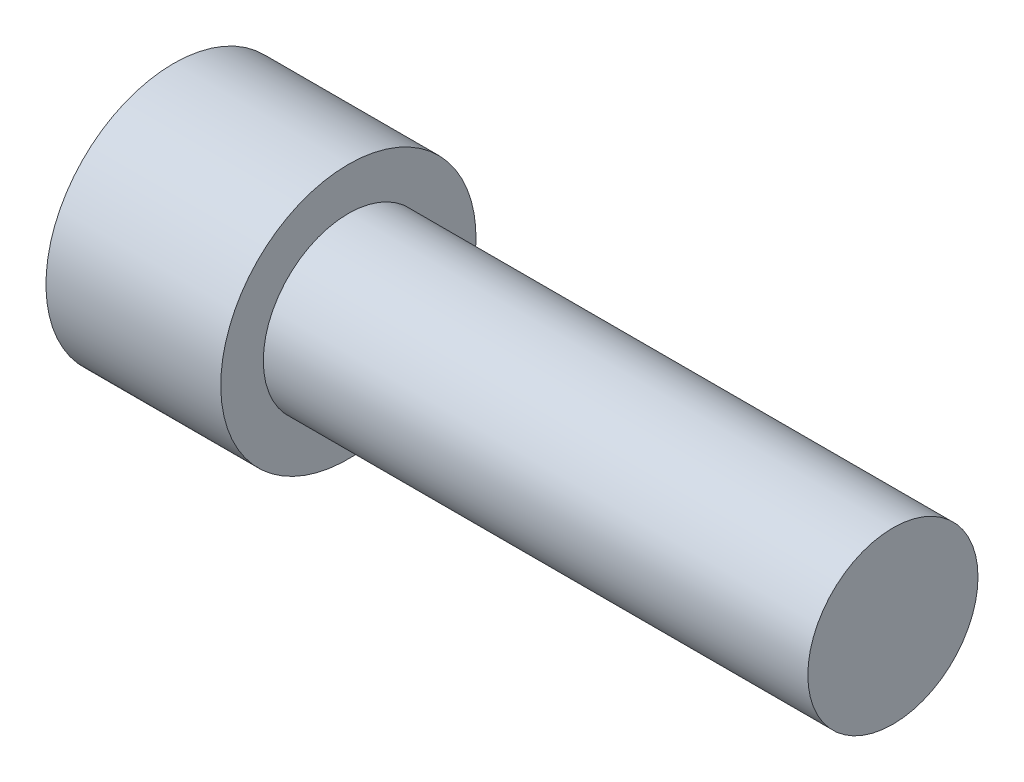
ISO-10303-21;
HEADER;
FILE_DESCRIPTION(('STEP AP214'),'2;1');
FILE_NAME('part.step','',(''),(''),'','','');
FILE_SCHEMA(('AUTOMOTIVE_DESIGN { 1 0 10303 214 1 1 1 1 }'));
ENDSEC;
DATA;
#1=APPLICATION_CONTEXT('core data for automotive mechanical design processes');
#2=APPLICATION_PROTOCOL_DEFINITION('international standard','automotive_design',2000,#1);
#3=PRODUCT_CONTEXT('',#1,'mechanical');
#4=PRODUCT('Part','Part','',(#3));
#5=PRODUCT_RELATED_PRODUCT_CATEGORY('part','',(#4));
#6=PRODUCT_DEFINITION_FORMATION('','',#4);
#7=PRODUCT_DEFINITION_CONTEXT('part definition',#1,'design');
#8=PRODUCT_DEFINITION('design','',#6,#7);
#9=PRODUCT_DEFINITION_SHAPE('','',#8);
#10=(LENGTH_UNIT() NAMED_UNIT(*) SI_UNIT(.MILLI.,.METRE.));
#11=(NAMED_UNIT(*) PLANE_ANGLE_UNIT() SI_UNIT($,.RADIAN.));
#12=(NAMED_UNIT(*) SI_UNIT($,.STERADIAN.) SOLID_ANGLE_UNIT());
#13=UNCERTAINTY_MEASURE_WITH_UNIT(LENGTH_MEASURE(1.E-05),#10,'distance_accuracy_value','');
#14=(GEOMETRIC_REPRESENTATION_CONTEXT(3) GLOBAL_UNCERTAINTY_ASSIGNED_CONTEXT((#13)) GLOBAL_UNIT_ASSIGNED_CONTEXT((#10,
#11,#12)) REPRESENTATION_CONTEXT('',''));
#15=CARTESIAN_POINT('',(0.,0.,0.));
#16=DIRECTION('',(0.,0.,1.));
#17=DIRECTION('',(1.,0.,0.));
#18=AXIS2_PLACEMENT_3D('',#15,#16,#17);
#19=CARTESIAN_POINT('',(33.5534,0.,0.));
#20=DIRECTION('',(1.,0.,0.));
#21=DIRECTION('',(0.,1.,0.));
#22=AXIS2_PLACEMENT_3D('',#19,#20,#21);
#23=PLANE('',#22);
#24=CARTESIAN_POINT('',(33.5534,0.,0.));
#25=DIRECTION('',(1.,0.,0.));
#26=DIRECTION('',(0.,1.,0.));
#27=AXIS2_PLACEMENT_3D('',#24,#25,#26);
#28=CIRCLE('',#27,3.96875);
#29=CARTESIAN_POINT('',(33.5534,3.96875,0.));
#30=VERTEX_POINT('',#29);
#31=EDGE_CURVE('E11',#30,#30,#28,.T.);
#32=ORIENTED_EDGE('',*,*,#31,.T.);
#33=EDGE_LOOP('',(#32));
#34=FACE_BOUND('',#33,.T.);
#35=ADVANCED_FACE('F380',(#34),#23,.T.);
#36=CARTESIAN_POINT('',(33.5534,0.,0.));
#37=DIRECTION('',(1.,0.,0.));
#38=DIRECTION('',(0.,1.,0.));
#39=AXIS2_PLACEMENT_3D('',#36,#37,#38);
#40=CYLINDRICAL_SURFACE('',#39,3.96875);
#41=CARTESIAN_POINT('',(8.1534,0.,0.));
#42=DIRECTION('',(1.,0.,0.));
#43=DIRECTION('',(0.,1.,0.));
#44=AXIS2_PLACEMENT_3D('',#41,#42,#43);
#45=CIRCLE('',#44,3.96875);
#46=CARTESIAN_POINT('',(8.1534,3.96875,0.));
#47=VERTEX_POINT('',#46);
#48=EDGE_CURVE('E387',#47,#47,#45,.T.);
#49=ORIENTED_EDGE('',*,*,#48,.T.);
#50=EDGE_LOOP('',(#49));
#51=FACE_BOUND('',#50,.T.);
#52=ORIENTED_EDGE('',*,*,#31,.F.);
#53=EDGE_LOOP('',(#52));
#54=FACE_BOUND('',#53,.T.);
#55=ADVANCED_FACE('F496',(#51,#54),#40,.T.);
#56=CARTESIAN_POINT('',(8.1534,5.953125,0.));
#57=DIRECTION('',(1.,0.,0.));
#58=DIRECTION('',(0.,1.,0.));
#59=AXIS2_PLACEMENT_3D('',#56,#57,#58);
#60=PLANE('',#59);
#61=CARTESIAN_POINT('',(8.1534,0.,0.));
#62=DIRECTION('',(1.,0.,0.));
#63=DIRECTION('',(0.,1.,0.));
#64=AXIS2_PLACEMENT_3D('',#61,#62,#63);
#65=CIRCLE('',#64,5.953125);
#66=CARTESIAN_POINT('',(8.1534,5.953125,0.));
#67=VERTEX_POINT('',#66);
#68=EDGE_CURVE('E491',#67,#67,#65,.T.);
#69=ORIENTED_EDGE('',*,*,#68,.T.);
#70=EDGE_LOOP('',(#69));
#71=FACE_BOUND('',#70,.T.);
#72=ORIENTED_EDGE('',*,*,#48,.F.);
#73=EDGE_LOOP('',(#72));
#74=FACE_BOUND('',#73,.T.);
#75=ADVANCED_FACE('F499',(#71,#74),#60,.T.);
#76=CARTESIAN_POINT('',(33.5534,0.,0.));
#77=DIRECTION('',(1.,0.,0.));
#78=DIRECTION('',(0.,1.,0.));
#79=AXIS2_PLACEMENT_3D('',#76,#77,#78);
#80=CYLINDRICAL_SURFACE('',#79,5.953125);
#81=CARTESIAN_POINT('',(0.,0.,0.));
#82=DIRECTION('',(1.,0.,0.));
#83=DIRECTION('',(0.,1.,0.));
#84=AXIS2_PLACEMENT_3D('',#81,#82,#83);
#85=CIRCLE('',#84,5.953125);
#86=CARTESIAN_POINT('',(0.,5.953125,0.));
#87=VERTEX_POINT('',#86);
#88=EDGE_CURVE('E482',#87,#87,#85,.T.);
#89=ORIENTED_EDGE('',*,*,#88,.T.);
#90=EDGE_LOOP('',(#89));
#91=FACE_BOUND('',#90,.T.);
#92=ORIENTED_EDGE('',*,*,#68,.F.);
#93=EDGE_LOOP('',(#92));
#94=FACE_BOUND('',#93,.T.);
#95=ADVANCED_FACE('F501',(#91,#94),#80,.T.);
#96=CARTESIAN_POINT('',(0.,0.,0.));
#97=DIRECTION('',(-1.,0.,0.));
#98=DIRECTION('',(0.,-1.,0.));
#99=AXIS2_PLACEMENT_3D('',#96,#97,#98);
#100=PLANE('',#99);
#101=DIRECTION('',(0.,0.866025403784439,0.5));
#102=VECTOR('',#101,1.);
#103=CARTESIAN_POINT('',(0.,-3.175,1.83308710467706));
#104=LINE('',#103,#102);
#105=CARTESIAN_POINT('',(0.,-3.175,1.83308710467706));
#106=VERTEX_POINT('',#105);
#107=CARTESIAN_POINT('',(0.,0.,3.66617420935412));
#108=VERTEX_POINT('',#107);
#109=EDGE_CURVE('E394',#106,#108,#104,.T.);
#110=ORIENTED_EDGE('',*,*,#109,.F.);
#111=DIRECTION('',(0.,0.,1.));
#112=VECTOR('',#111,1.);
#113=CARTESIAN_POINT('',(0.,-3.175,-1.83308710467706));
#114=LINE('',#113,#112);
#115=CARTESIAN_POINT('',(0.,-3.175,-1.83308710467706));
#116=VERTEX_POINT('',#115);
#117=EDGE_CURVE('E464',#116,#106,#114,.T.);
#118=ORIENTED_EDGE('',*,*,#117,.F.);
#119=DIRECTION('',(0.,-0.866025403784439,0.5));
#120=VECTOR('',#119,1.);
#121=CARTESIAN_POINT('',(0.,0.,-3.66617420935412));
#122=LINE('',#121,#120);
#123=CARTESIAN_POINT('',(0.,0.,-3.66617420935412));
#124=VERTEX_POINT('',#123);
#125=EDGE_CURVE('E458',#124,#116,#122,.T.);
#126=ORIENTED_EDGE('',*,*,#125,.F.);
#127=DIRECTION('',(0.,-0.866025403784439,-0.5));
#128=VECTOR('',#127,1.);
#129=CARTESIAN_POINT('',(0.,3.175,-1.83308710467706));
#130=LINE('',#129,#128);
#131=CARTESIAN_POINT('',(0.,3.175,-1.83308710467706));
#132=VERTEX_POINT('',#131);
#133=EDGE_CURVE('E456',#132,#124,#130,.T.);
#134=ORIENTED_EDGE('',*,*,#133,.F.);
#135=DIRECTION('',(0.,0.,-1.));
#136=VECTOR('',#135,1.);
#137=CARTESIAN_POINT('',(0.,3.175,1.83308710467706));
#138=LINE('',#137,#136);
#139=CARTESIAN_POINT('',(0.,3.175,1.83308710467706));
#140=VERTEX_POINT('',#139);
#141=EDGE_CURVE('E437',#140,#132,#138,.T.);
#142=ORIENTED_EDGE('',*,*,#141,.F.);
#143=DIRECTION('',(0.,0.866025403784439,-0.5));
#144=VECTOR('',#143,1.);
#145=CARTESIAN_POINT('',(0.,0.,3.66617420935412));
#146=LINE('',#145,#144);
#147=EDGE_CURVE('E448',#108,#140,#146,.T.);
#148=ORIENTED_EDGE('',*,*,#147,.F.);
#149=EDGE_LOOP('',(#110,#118,#126,#134,#142,#148));
#150=FACE_BOUND('',#149,.T.);
#151=ORIENTED_EDGE('',*,*,#88,.F.);
#152=EDGE_LOOP('',(#151));
#153=FACE_BOUND('',#152,.T.);
#154=ADVANCED_FACE('F452',(#150,#153),#100,.T.);
#155=CARTESIAN_POINT('',(3.81,-3.175,1.83308710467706));
#156=DIRECTION('',(0.,-0.5,0.866025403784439));
#157=DIRECTION('',(0.,-0.866025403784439,-0.5));
#158=AXIS2_PLACEMENT_3D('',#155,#156,#157);
#159=PLANE('',#158);
#160=ORIENTED_EDGE('',*,*,#109,.T.);
#161=DIRECTION('',(-1.,0.,0.));
#162=VECTOR('',#161,1.);
#163=CARTESIAN_POINT('',(3.81,0.,3.66617420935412));
#164=LINE('',#163,#162);
#165=CARTESIAN_POINT('',(3.81,0.,3.66617420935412));
#166=VERTEX_POINT('',#165);
#167=EDGE_CURVE('E445',#166,#108,#164,.T.);
#168=ORIENTED_EDGE('',*,*,#167,.F.);
#169=DIRECTION('',(0.,0.866025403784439,0.5));
#170=VECTOR('',#169,1.);
#171=CARTESIAN_POINT('',(3.81,-3.175,1.83308710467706));
#172=LINE('',#171,#170);
#173=CARTESIAN_POINT('',(3.81,-3.175,1.83308710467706));
#174=VERTEX_POINT('',#173);
#175=EDGE_CURVE('E466',#174,#166,#172,.T.);
#176=ORIENTED_EDGE('',*,*,#175,.F.);
#177=DIRECTION('',(-1.,0.,0.));
#178=VECTOR('',#177,1.);
#179=CARTESIAN_POINT('',(3.81,-3.175,1.83308710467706));
#180=LINE('',#179,#178);
#181=EDGE_CURVE('E401',#174,#106,#180,.T.);
#182=ORIENTED_EDGE('',*,*,#181,.T.);
#183=EDGE_LOOP('',(#160,#168,#176,#182));
#184=FACE_BOUND('',#183,.T.);
#185=ADVANCED_FACE('F532',(#184),#159,.F.);
#186=CARTESIAN_POINT('',(3.81,-3.175,-1.83308710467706));
#187=DIRECTION('',(0.,-1.,0.));
#188=DIRECTION('',(1.,0.,0.));
#189=AXIS2_PLACEMENT_3D('',#186,#187,#188);
#190=PLANE('',#189);
#191=ORIENTED_EDGE('',*,*,#117,.T.);
#192=ORIENTED_EDGE('',*,*,#181,.F.);
#193=DIRECTION('',(0.,0.,1.));
#194=VECTOR('',#193,1.);
#195=CARTESIAN_POINT('',(3.81,-3.175,-1.83308710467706));
#196=LINE('',#195,#194);
#197=CARTESIAN_POINT('',(3.81,-3.175,-1.83308710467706));
#198=VERTEX_POINT('',#197);
#199=EDGE_CURVE('E478',#198,#174,#196,.T.);
#200=ORIENTED_EDGE('',*,*,#199,.F.);
#201=DIRECTION('',(-1.,0.,0.));
#202=VECTOR('',#201,1.);
#203=CARTESIAN_POINT('',(3.81,-3.175,-1.83308710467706));
#204=LINE('',#203,#202);
#205=EDGE_CURVE('E483',#198,#116,#204,.T.);
#206=ORIENTED_EDGE('',*,*,#205,.T.);
#207=EDGE_LOOP('',(#191,#192,#200,#206));
#208=FACE_BOUND('',#207,.T.);
#209=ADVANCED_FACE('F539',(#208),#190,.F.);
#210=CARTESIAN_POINT('',(3.81,0.,-3.66617420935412));
#211=DIRECTION('',(0.,-0.5,-0.866025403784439));
#212=DIRECTION('',(0.,0.866025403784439,-0.5));
#213=AXIS2_PLACEMENT_3D('',#210,#211,#212);
#214=PLANE('',#213);
#215=ORIENTED_EDGE('',*,*,#125,.T.);
#216=ORIENTED_EDGE('',*,*,#205,.F.);
#217=DIRECTION('',(0.,-0.866025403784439,0.5));
#218=VECTOR('',#217,1.);
#219=CARTESIAN_POINT('',(3.81,0.,-3.66617420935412));
#220=LINE('',#219,#218);
#221=CARTESIAN_POINT('',(3.81,0.,-3.66617420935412));
#222=VERTEX_POINT('',#221);
#223=EDGE_CURVE('E475',#222,#198,#220,.T.);
#224=ORIENTED_EDGE('',*,*,#223,.F.);
#225=DIRECTION('',(-1.,0.,0.));
#226=VECTOR('',#225,1.);
#227=CARTESIAN_POINT('',(3.81,0.,-3.66617420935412));
#228=LINE('',#227,#226);
#229=EDGE_CURVE('E485',#222,#124,#228,.T.);
#230=ORIENTED_EDGE('',*,*,#229,.T.);
#231=EDGE_LOOP('',(#215,#216,#224,#230));
#232=FACE_BOUND('',#231,.T.);
#233=ADVANCED_FACE('F546',(#232),#214,.F.);
#234=CARTESIAN_POINT('',(3.81,3.175,-1.83308710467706));
#235=DIRECTION('',(0.,0.5,-0.866025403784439));
#236=DIRECTION('',(0.,0.866025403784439,0.5));
#237=AXIS2_PLACEMENT_3D('',#234,#235,#236);
#238=PLANE('',#237);
#239=ORIENTED_EDGE('',*,*,#133,.T.);
#240=ORIENTED_EDGE('',*,*,#229,.F.);
#241=DIRECTION('',(0.,-0.866025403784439,-0.5));
#242=VECTOR('',#241,1.);
#243=CARTESIAN_POINT('',(3.81,3.175,-1.83308710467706));
#244=LINE('',#243,#242);
#245=CARTESIAN_POINT('',(3.81,3.175,-1.83308710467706));
#246=VERTEX_POINT('',#245);
#247=EDGE_CURVE('E472',#246,#222,#244,.T.);
#248=ORIENTED_EDGE('',*,*,#247,.F.);
#249=DIRECTION('',(-1.,0.,0.));
#250=VECTOR('',#249,1.);
#251=CARTESIAN_POINT('',(3.81,3.175,-1.83308710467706));
#252=LINE('',#251,#250);
#253=EDGE_CURVE('E444',#246,#132,#252,.T.);
#254=ORIENTED_EDGE('',*,*,#253,.T.);
#255=EDGE_LOOP('',(#239,#240,#248,#254));
#256=FACE_BOUND('',#255,.T.);
#257=ADVANCED_FACE('F553',(#256),#238,.F.);
#258=CARTESIAN_POINT('',(3.81,3.175,1.83308710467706));
#259=DIRECTION('',(0.,1.,0.));
#260=DIRECTION('',(0.,0.,1.));
#261=AXIS2_PLACEMENT_3D('',#258,#259,#260);
#262=PLANE('',#261);
#263=ORIENTED_EDGE('',*,*,#141,.T.);
#264=ORIENTED_EDGE('',*,*,#253,.F.);
#265=DIRECTION('',(0.,0.,-1.));
#266=VECTOR('',#265,1.);
#267=CARTESIAN_POINT('',(3.81,3.175,1.83308710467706));
#268=LINE('',#267,#266);
#269=CARTESIAN_POINT('',(3.81,3.175,1.83308710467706));
#270=VERTEX_POINT('',#269);
#271=EDGE_CURVE('E440',#270,#246,#268,.T.);
#272=ORIENTED_EDGE('',*,*,#271,.F.);
#273=DIRECTION('',(-1.,0.,0.));
#274=VECTOR('',#273,1.);
#275=CARTESIAN_POINT('',(3.81,3.175,1.83308710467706));
#276=LINE('',#275,#274);
#277=EDGE_CURVE('E433',#270,#140,#276,.T.);
#278=ORIENTED_EDGE('',*,*,#277,.T.);
#279=EDGE_LOOP('',(#263,#264,#272,#278));
#280=FACE_BOUND('',#279,.T.);
#281=ADVANCED_FACE('F435',(#280),#262,.F.);
#282=CARTESIAN_POINT('',(3.81,0.,3.66617420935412));
#283=DIRECTION('',(0.,0.5,0.866025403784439));
#284=DIRECTION('',(0.,-0.866025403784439,0.5));
#285=AXIS2_PLACEMENT_3D('',#282,#283,#284);
#286=PLANE('',#285);
#287=ORIENTED_EDGE('',*,*,#147,.T.);
#288=ORIENTED_EDGE('',*,*,#277,.F.);
#289=DIRECTION('',(0.,0.866025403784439,-0.5));
#290=VECTOR('',#289,1.);
#291=CARTESIAN_POINT('',(3.81,0.,3.66617420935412));
#292=LINE('',#291,#290);
#293=EDGE_CURVE('E469',#166,#270,#292,.T.);
#294=ORIENTED_EDGE('',*,*,#293,.F.);
#295=ORIENTED_EDGE('',*,*,#167,.T.);
#296=EDGE_LOOP('',(#287,#288,#294,#295));
#297=FACE_BOUND('',#296,.T.);
#298=ADVANCED_FACE('F449',(#297),#286,.F.);
#299=CARTESIAN_POINT('',(3.81,-3.175,1.83308710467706));
#300=DIRECTION('',(1.,0.,0.));
#301=DIRECTION('',(0.,1.,0.));
#302=AXIS2_PLACEMENT_3D('',#299,#300,#301);
#303=PLANE('',#302);
#304=ORIENTED_EDGE('',*,*,#175,.T.);
#305=ORIENTED_EDGE('',*,*,#293,.T.);
#306=ORIENTED_EDGE('',*,*,#271,.T.);
#307=ORIENTED_EDGE('',*,*,#247,.T.);
#308=ORIENTED_EDGE('',*,*,#223,.T.);
#309=ORIENTED_EDGE('',*,*,#199,.T.);
#310=EDGE_LOOP('',(#304,#305,#306,#307,#308,#309));
#311=FACE_BOUND('',#310,.T.);
#312=ADVANCED_FACE('F574',(#311),#303,.F.);
#313=CLOSED_SHELL('',(#35,#55,#75,#95,#154,#185,#209,#233,#257,#281,#298,#312));
#314=MANIFOLD_SOLID_BREP('B2',#313);
#315=ADVANCED_BREP_SHAPE_REPRESENTATION('',(#18,#314),#14);
#316=SHAPE_DEFINITION_REPRESENTATION(#9,#315);
ENDSEC;
END-ISO-10303-21;
